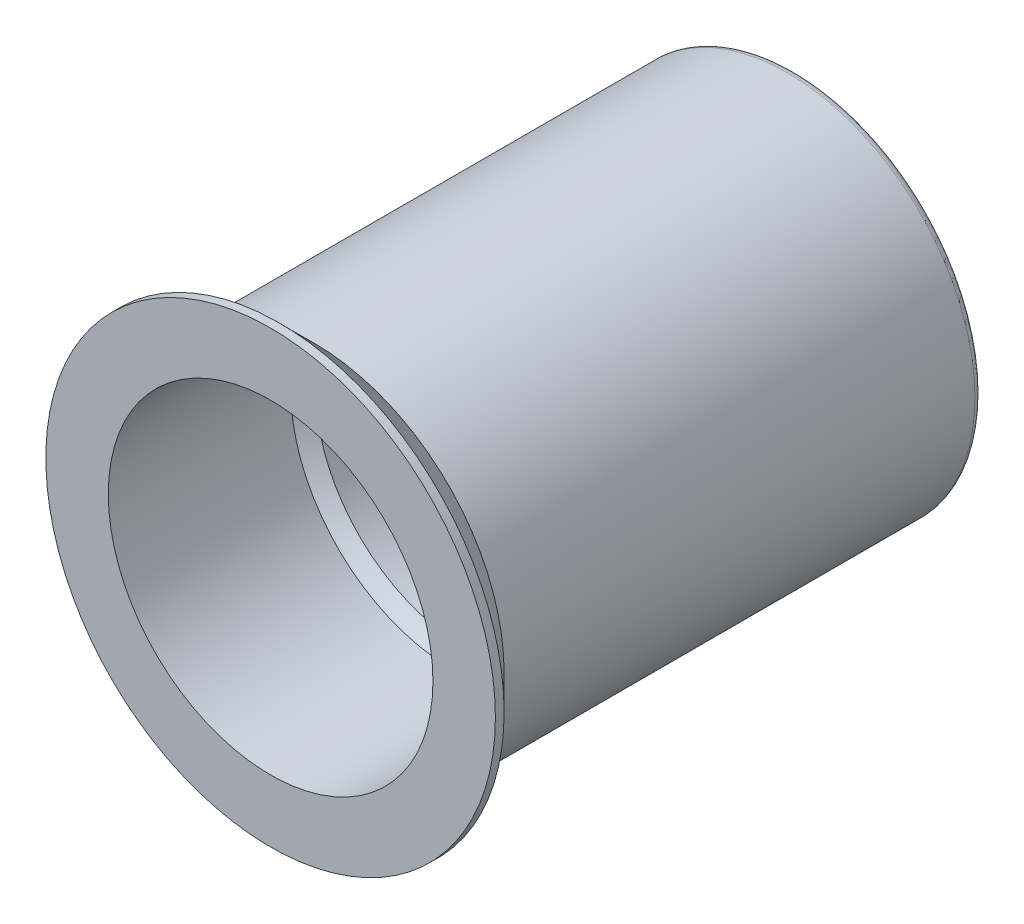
ISO-10303-21;
HEADER;
FILE_DESCRIPTION(('STEP AP214'),'2;1');
FILE_NAME('part.step','',(''),(''),'','','');
FILE_SCHEMA(('AUTOMOTIVE_DESIGN { 1 0 10303 214 1 1 1 1 }'));
ENDSEC;
DATA;
#1=APPLICATION_CONTEXT('core data for automotive mechanical design processes');
#2=APPLICATION_PROTOCOL_DEFINITION('international standard','automotive_design',2000,#1);
#3=PRODUCT_CONTEXT('',#1,'mechanical');
#4=PRODUCT('Part','Part','',(#3));
#5=PRODUCT_RELATED_PRODUCT_CATEGORY('part','',(#4));
#6=PRODUCT_DEFINITION_FORMATION('','',#4);
#7=PRODUCT_DEFINITION_CONTEXT('part definition',#1,'design');
#8=PRODUCT_DEFINITION('design','',#6,#7);
#9=PRODUCT_DEFINITION_SHAPE('','',#8);
#10=(LENGTH_UNIT() NAMED_UNIT(*) SI_UNIT(.MILLI.,.METRE.));
#11=(NAMED_UNIT(*) PLANE_ANGLE_UNIT() SI_UNIT($,.RADIAN.));
#12=(NAMED_UNIT(*) SI_UNIT($,.STERADIAN.) SOLID_ANGLE_UNIT());
#13=UNCERTAINTY_MEASURE_WITH_UNIT(LENGTH_MEASURE(1.E-05),#10,'distance_accuracy_value','');
#14=(GEOMETRIC_REPRESENTATION_CONTEXT(3) GLOBAL_UNCERTAINTY_ASSIGNED_CONTEXT((#13)) GLOBAL_UNIT_ASSIGNED_CONTEXT((#10,
#11,#12)) REPRESENTATION_CONTEXT('',''));
#15=CARTESIAN_POINT('',(0.,0.,0.));
#16=DIRECTION('',(0.,0.,1.));
#17=DIRECTION('',(1.,0.,0.));
#18=AXIS2_PLACEMENT_3D('',#15,#16,#17);
#19=CARTESIAN_POINT('',(0.,0.,-21.0000000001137));
#20=DIRECTION('',(0.,0.,1.));
#21=DIRECTION('',(1.,0.,0.));
#22=AXIS2_PLACEMENT_3D('',#19,#20,#21);
#23=CYLINDRICAL_SURFACE('',#22,7.5);
#24=CARTESIAN_POINT('',(0.,0.,-20.7000000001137));
#25=DIRECTION('',(0.,0.,-1.));
#26=DIRECTION('',(-1.,0.,0.));
#27=AXIS2_PLACEMENT_3D('',#24,#25,#26);
#28=CIRCLE('',#27,7.5);
#29=CARTESIAN_POINT('',(7.5,0.,-20.7000000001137));
#30=VERTEX_POINT('',#29);
#31=EDGE_CURVE('E53',#30,#30,#28,.F.);
#32=CARTESIAN_POINT('',(0.,0.,-1.8));
#33=DIRECTION('',(0.,0.,1.));
#34=DIRECTION('',(1.,0.,0.));
#35=AXIS2_PLACEMENT_3D('',#32,#33,#34);
#36=CIRCLE('',#35,7.5);
#37=CARTESIAN_POINT('',(7.5,0.,-1.8));
#38=VERTEX_POINT('',#37);
#39=EDGE_CURVE('E59',#38,#38,#36,.F.);
#40=CARTESIAN_POINT('',(7.5,0.,-20.7000000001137));
#41=CARTESIAN_POINT('',(7.5,0.,-20.5031250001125));
#42=CARTESIAN_POINT('',(7.5,0.,-20.3062500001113));
#43=CARTESIAN_POINT('',(7.5,0.,-19.9125000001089));
#44=CARTESIAN_POINT('',(7.5,0.,-19.7156250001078));
#45=CARTESIAN_POINT('',(7.5,0.,-19.3218750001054));
#46=CARTESIAN_POINT('',(7.5,0.,-19.1250000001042));
#47=CARTESIAN_POINT('',(7.5,0.,-18.7312500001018));
#48=CARTESIAN_POINT('',(7.5,0.,-18.5343750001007));
#49=CARTESIAN_POINT('',(7.5,0.,-18.1406250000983));
#50=CARTESIAN_POINT('',(7.5,0.,-17.9437500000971));
#51=CARTESIAN_POINT('',(7.5,0.,-17.5500000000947));
#52=CARTESIAN_POINT('',(7.5,0.,-17.3531250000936));
#53=CARTESIAN_POINT('',(7.5,0.,-16.9593750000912));
#54=CARTESIAN_POINT('',(7.5,0.,-16.76250000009));
#55=CARTESIAN_POINT('',(7.5,0.,-16.3687500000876));
#56=CARTESIAN_POINT('',(7.5,0.,-16.1718750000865));
#57=CARTESIAN_POINT('',(7.5,0.,-15.7781250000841));
#58=CARTESIAN_POINT('',(7.5,0.,-15.5812500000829));
#59=CARTESIAN_POINT('',(7.5,0.,-15.1875000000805));
#60=CARTESIAN_POINT('',(7.5,0.,-14.9906250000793));
#61=CARTESIAN_POINT('',(7.5,0.,-14.596875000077));
#62=CARTESIAN_POINT('',(7.5,0.,-14.4000000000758));
#63=CARTESIAN_POINT('',(7.5,0.,-14.0062500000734));
#64=CARTESIAN_POINT('',(7.5,0.,-13.8093750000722));
#65=CARTESIAN_POINT('',(7.5,0.,-13.4156250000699));
#66=CARTESIAN_POINT('',(7.5,0.,-13.2187500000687));
#67=CARTESIAN_POINT('',(7.5,0.,-12.8250000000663));
#68=CARTESIAN_POINT('',(7.5,0.,-12.6281250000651));
#69=CARTESIAN_POINT('',(7.5,0.,-12.2343750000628));
#70=CARTESIAN_POINT('',(7.5,0.,-12.0375000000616));
#71=CARTESIAN_POINT('',(7.5,0.,-11.6437500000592));
#72=CARTESIAN_POINT('',(7.5,0.,-11.446875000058));
#73=CARTESIAN_POINT('',(7.5,0.,-11.0531250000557));
#74=CARTESIAN_POINT('',(7.5,0.,-10.8562500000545));
#75=CARTESIAN_POINT('',(7.5,0.,-10.4625000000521));
#76=CARTESIAN_POINT('',(7.5,0.,-10.2656250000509));
#77=CARTESIAN_POINT('',(7.5,0.,-9.87187500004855));
#78=CARTESIAN_POINT('',(7.5,0.,-9.67500000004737));
#79=CARTESIAN_POINT('',(7.5,0.,-9.281250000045));
#80=CARTESIAN_POINT('',(7.5,0.,-9.08437500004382));
#81=CARTESIAN_POINT('',(7.5,0.,-8.69062500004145));
#82=CARTESIAN_POINT('',(7.5,0.,-8.49375000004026));
#83=CARTESIAN_POINT('',(7.5,0.,-8.10000000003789));
#84=CARTESIAN_POINT('',(7.5,0.,-7.90312500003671));
#85=CARTESIAN_POINT('',(7.5,0.,-7.50937500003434));
#86=CARTESIAN_POINT('',(7.5,0.,-7.31250000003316));
#87=CARTESIAN_POINT('',(7.5,0.,-6.91875000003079));
#88=CARTESIAN_POINT('',(7.5,0.,-6.72187500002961));
#89=CARTESIAN_POINT('',(7.5,0.,-6.32812500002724));
#90=CARTESIAN_POINT('',(7.5,0.,-6.13125000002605));
#91=CARTESIAN_POINT('',(7.5,0.,-5.73750000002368));
#92=CARTESIAN_POINT('',(7.5,0.,-5.5406250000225));
#93=CARTESIAN_POINT('',(7.5,0.,-5.14687500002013));
#94=CARTESIAN_POINT('',(7.5,0.,-4.95000000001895));
#95=CARTESIAN_POINT('',(7.5,0.,-4.55625000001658));
#96=CARTESIAN_POINT('',(7.5,0.,-4.3593750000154));
#97=CARTESIAN_POINT('',(7.5,0.,-3.96562500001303));
#98=CARTESIAN_POINT('',(7.5,0.,-3.76875000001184));
#99=CARTESIAN_POINT('',(7.5,0.,-3.37500000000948));
#100=CARTESIAN_POINT('',(7.5,0.,-3.17812500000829));
#101=CARTESIAN_POINT('',(7.5,0.,-2.78437500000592));
#102=CARTESIAN_POINT('',(7.5,0.,-2.58750000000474));
#103=CARTESIAN_POINT('',(7.5,0.,-2.19375000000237));
#104=CARTESIAN_POINT('',(7.5,0.,-1.99687500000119));
#105=CARTESIAN_POINT('',(7.5,0.,-1.8));
#106=B_SPLINE_CURVE_WITH_KNOTS('',3,(#40,#41,#42,#43,#44,#45,#46,#47,#48,#49,#50,#51,#52,#53,
#54,#55,#56,#57,#58,#59,#60,#61,#62,#63,#64,#65,#66,#67,#68,#69,#70,#71,#72,#73,#74,#75,#76,#77,
#78,#79,#80,#81,#82,#83,#84,#85,#86,#87,#88,#89,#90,#91,#92,#93,#94,#95,#96,#97,#98,#99,#100,
#101,#102,#103,#104,#105),.UNSPECIFIED.,.F.,.F.,(4,2,2,2,2,2,2,2,2,2,2,2,2,2,2,2,2,2,2,2,2,2,2,
2,2,2,2,2,2,2,2,2,4),(0.,0.590625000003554,1.18125000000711,1.77187500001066,2.36250000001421,
2.95312500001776,3.54375000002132,4.13437500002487,4.72500000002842,5.31562500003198,
5.90625000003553,6.49687500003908,7.08750000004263,7.67812500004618,8.26875000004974,
8.85937500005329,9.45000000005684,10.0406250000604,10.6312500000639,11.2218750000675,
11.8125000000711,12.4031250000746,12.9937500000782,13.5843750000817,14.1750000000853,
14.7656250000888,15.3562500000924,15.9468750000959,16.5375000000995,17.128125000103,
17.7187500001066,18.3093750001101,18.9000000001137),.UNSPECIFIED.);
#107=EDGE_CURVE('BSEAM33',#30,#38,#106,.T.);
#108=ORIENTED_EDGE('',*,*,#31,.T.);
#109=ORIENTED_EDGE('',*,*,#39,.T.);
#110=ORIENTED_EDGE('',*,*,#107,.T.);
#111=ORIENTED_EDGE('',*,*,#107,.F.);
#112=EDGE_LOOP('',(#108,#110,#109,#111));
#113=FACE_BOUND('',#112,.T.);
#114=ADVANCED_FACE('F33',(#113),#23,.T.);
#115=CARTESIAN_POINT('',(0.,0.,-21.0000000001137));
#116=DIRECTION('',(0.,0.,-1.));
#117=DIRECTION('',(-1.,0.,0.));
#118=AXIS2_PLACEMENT_3D('',#115,#116,#117);
#119=PLANE('',#118);
#120=CARTESIAN_POINT('',(0.,0.,-21.0000000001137));
#121=DIRECTION('',(0.,0.,-1.));
#122=DIRECTION('',(-1.,0.,0.));
#123=AXIS2_PLACEMENT_3D('',#120,#121,#122);
#124=CIRCLE('',#123,6.48);
#125=CARTESIAN_POINT('',(-6.48,0.,-21.0000000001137));
#126=VERTEX_POINT('',#125);
#127=EDGE_CURVE('E40',#126,#126,#124,.F.);
#128=ORIENTED_EDGE('',*,*,#127,.T.);
#129=EDGE_LOOP('',(#128));
#130=FACE_BOUND('',#129,.T.);
#131=CARTESIAN_POINT('',(0.,0.,-21.0000000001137));
#132=DIRECTION('',(0.,0.,-1.));
#133=DIRECTION('',(-1.,0.,0.));
#134=AXIS2_PLACEMENT_3D('',#131,#132,#133);
#135=CIRCLE('',#134,7.2);
#136=CARTESIAN_POINT('',(-7.2,0.,-21.0000000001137));
#137=VERTEX_POINT('',#136);
#138=EDGE_CURVE('E56',#137,#137,#135,.T.);
#139=ORIENTED_EDGE('',*,*,#138,.T.);
#140=EDGE_LOOP('',(#139));
#141=FACE_BOUND('',#140,.T.);
#142=ADVANCED_FACE('F99',(#130,#141),#119,.T.);
#143=CARTESIAN_POINT('',(0.,0.,-0.350000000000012));
#144=DIRECTION('',(0.,0.,1.));
#145=DIRECTION('',(1.,0.,0.));
#146=AXIS2_PLACEMENT_3D('',#143,#144,#145);
#147=CONICAL_SURFACE('',#146,9.,0.785398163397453);
#148=CARTESIAN_POINT('',(0.,0.,-1.72509203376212));
#149=DIRECTION('',(0.,0.,1.));
#150=DIRECTION('',(1.,0.,0.));
#151=AXIS2_PLACEMENT_3D('',#148,#149,#150);
#152=CIRCLE('',#151,7.62490796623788);
#153=CARTESIAN_POINT('',(7.62490796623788,0.,-1.72509203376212));
#154=VERTEX_POINT('',#153);
#155=EDGE_CURVE('E48',#154,#154,#152,.T.);
#156=ORIENTED_EDGE('',*,*,#155,.T.);
#157=EDGE_LOOP('',(#156));
#158=FACE_BOUND('',#157,.T.);
#159=CARTESIAN_POINT('',(0.,0.,-0.350000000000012));
#160=DIRECTION('',(0.,0.,1.));
#161=DIRECTION('',(1.,0.,0.));
#162=AXIS2_PLACEMENT_3D('',#159,#160,#161);
#163=CIRCLE('',#162,9.);
#164=CARTESIAN_POINT('',(9.,0.,-0.350000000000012));
#165=VERTEX_POINT('',#164);
#166=EDGE_CURVE('E63',#165,#165,#163,.T.);
#167=ORIENTED_EDGE('',*,*,#166,.F.);
#168=EDGE_LOOP('',(#167));
#169=FACE_BOUND('',#168,.T.);
#170=ADVANCED_FACE('F89',(#158,#169),#147,.T.);
#171=CARTESIAN_POINT('',(0.,0.,0.));
#172=DIRECTION('',(0.,0.,1.));
#173=DIRECTION('',(1.,0.,0.));
#174=AXIS2_PLACEMENT_3D('',#171,#172,#173);
#175=PLANE('',#174);
#176=CARTESIAN_POINT('',(0.,0.,5.6843418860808E-11));
#177=DIRECTION('',(0.,0.,1.));
#178=DIRECTION('',(1.,0.,0.));
#179=AXIS2_PLACEMENT_3D('',#176,#177,#178);
#180=CIRCLE('',#179,6.5);
#181=CARTESIAN_POINT('',(6.5,0.,5.6843418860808E-11));
#182=VERTEX_POINT('',#181);
#183=EDGE_CURVE('E69',#182,#182,#180,.T.);
#184=ORIENTED_EDGE('',*,*,#183,.F.);
#185=EDGE_LOOP('',(#184));
#186=FACE_BOUND('',#185,.T.);
#187=CARTESIAN_POINT('',(0.,0.,0.));
#188=DIRECTION('',(0.,0.,1.));
#189=DIRECTION('',(1.,0.,0.));
#190=AXIS2_PLACEMENT_3D('',#187,#188,#189);
#191=CIRCLE('',#190,9.);
#192=CARTESIAN_POINT('',(9.,0.,0.));
#193=VERTEX_POINT('',#192);
#194=EDGE_CURVE('E60',#193,#193,#191,.T.);
#195=ORIENTED_EDGE('',*,*,#194,.T.);
#196=EDGE_LOOP('',(#195));
#197=FACE_BOUND('',#196,.T.);
#198=ADVANCED_FACE('F86',(#186,#197),#175,.T.);
#199=CARTESIAN_POINT('',(0.,0.,-1.8));
#200=DIRECTION('',(0.,0.,1.));
#201=DIRECTION('',(1.,0.,0.));
#202=AXIS2_PLACEMENT_3D('',#199,#200,#201);
#203=CYLINDRICAL_SURFACE('',#202,9.);
#204=ORIENTED_EDGE('',*,*,#194,.F.);
#205=EDGE_LOOP('',(#204));
#206=FACE_BOUND('',#205,.T.);
#207=ORIENTED_EDGE('',*,*,#166,.T.);
#208=EDGE_LOOP('',(#207));
#209=FACE_BOUND('',#208,.T.);
#210=ADVANCED_FACE('F82',(#206,#209),#203,.T.);
#211=CARTESIAN_POINT('',(0.,0.,-7.29999999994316));
#212=DIRECTION('',(0.,0.,1.));
#213=DIRECTION('',(1.,0.,0.));
#214=AXIS2_PLACEMENT_3D('',#211,#212,#213);
#215=CYLINDRICAL_SURFACE('',#214,6.5);
#216=CARTESIAN_POINT('',(0.,0.,-7.29999999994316));
#217=DIRECTION('',(0.,0.,1.));
#218=DIRECTION('',(1.,0.,0.));
#219=AXIS2_PLACEMENT_3D('',#216,#217,#218);
#220=CIRCLE('',#219,6.5);
#221=CARTESIAN_POINT('',(6.5,0.,-7.29999999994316));
#222=VERTEX_POINT('',#221);
#223=EDGE_CURVE('E68',#222,#222,#220,.T.);
#224=ORIENTED_EDGE('',*,*,#223,.F.);
#225=EDGE_LOOP('',(#224));
#226=FACE_BOUND('',#225,.T.);
#227=ORIENTED_EDGE('',*,*,#183,.T.);
#228=EDGE_LOOP('',(#227));
#229=FACE_BOUND('',#228,.T.);
#230=ADVANCED_FACE('F78',(#226,#229),#215,.F.);
#231=CARTESIAN_POINT('',(0.,0.,-21.0000000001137));
#232=DIRECTION('',(0.,0.,1.));
#233=DIRECTION('',(1.,0.,0.));
#234=AXIS2_PLACEMENT_3D('',#231,#232,#233);
#235=CYLINDRICAL_SURFACE('',#234,6.);
#236=CARTESIAN_POINT('',(0.,0.,-20.5200000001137));
#237=DIRECTION('',(0.,0.,-1.));
#238=DIRECTION('',(-1.,0.,0.));
#239=AXIS2_PLACEMENT_3D('',#236,#237,#238);
#240=CIRCLE('',#239,6.);
#241=CARTESIAN_POINT('',(-6.,0.,-20.5200000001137));
#242=VERTEX_POINT('',#241);
#243=EDGE_CURVE('E10',#242,#242,#240,.T.);
#244=ORIENTED_EDGE('',*,*,#243,.T.);
#245=EDGE_LOOP('',(#244));
#246=FACE_BOUND('',#245,.T.);
#247=CARTESIAN_POINT('',(0.,0.,-7.80000000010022));
#248=DIRECTION('',(0.,0.,1.));
#249=DIRECTION('',(1.,0.,0.));
#250=AXIS2_PLACEMENT_3D('',#247,#248,#249);
#251=CIRCLE('',#250,6.);
#252=CARTESIAN_POINT('',(6.,0.,-7.80000000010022));
#253=VERTEX_POINT('',#252);
#254=EDGE_CURVE('E44',#253,#253,#251,.T.);
#255=ORIENTED_EDGE('',*,*,#254,.T.);
#256=EDGE_LOOP('',(#255));
#257=FACE_BOUND('',#256,.T.);
#258=ADVANCED_FACE('F81',(#246,#257),#235,.F.);
#259=CARTESIAN_POINT('',(0.,0.,-20.7000000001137));
#260=DIRECTION('',(0.,0.,-1.));
#261=DIRECTION('',(-1.,0.,0.));
#262=AXIS2_PLACEMENT_3D('',#259,#260,#261);
#263=TOROIDAL_SURFACE('',#262,7.2,0.3);
#264=ORIENTED_EDGE('',*,*,#31,.F.);
#265=EDGE_LOOP('',(#264));
#266=FACE_BOUND('',#265,.T.);
#267=ORIENTED_EDGE('',*,*,#138,.F.);
#268=EDGE_LOOP('',(#267));
#269=FACE_BOUND('',#268,.T.);
#270=ADVANCED_FACE('F113',(#266,#269),#263,.T.);
#271=CARTESIAN_POINT('',(0.,0.,-1.51295999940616));
#272=DIRECTION('',(0.,0.,-1.));
#273=DIRECTION('',(-1.,0.,0.));
#274=AXIS2_PLACEMENT_3D('',#271,#272,#273);
#275=TOROIDAL_SURFACE('',#274,7.41277593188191,0.3);
#276=ORIENTED_EDGE('',*,*,#39,.F.);
#277=EDGE_LOOP('',(#276));
#278=FACE_BOUND('',#277,.T.);
#279=ORIENTED_EDGE('',*,*,#155,.F.);
#280=EDGE_LOOP('',(#279));
#281=FACE_BOUND('',#280,.T.);
#282=ADVANCED_FACE('F116',(#278,#281),#275,.T.);
#283=CARTESIAN_POINT('',(0.,0.,-7.80000000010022));
#284=DIRECTION('',(0.,0.,1.));
#285=DIRECTION('',(1.,0.,0.));
#286=AXIS2_PLACEMENT_3D('',#283,#284,#285);
#287=CONICAL_SURFACE('',#286,6.,0.785398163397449);
#288=ORIENTED_EDGE('',*,*,#223,.T.);
#289=EDGE_LOOP('',(#288));
#290=FACE_BOUND('',#289,.T.);
#291=ORIENTED_EDGE('',*,*,#254,.F.);
#292=EDGE_LOOP('',(#291));
#293=FACE_BOUND('',#292,.T.);
#294=ADVANCED_FACE('F75',(#290,#293),#287,.F.);
#295=CARTESIAN_POINT('',(0.,0.,-21.0000000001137));
#296=DIRECTION('',(0.,0.,-1.));
#297=DIRECTION('',(-1.,0.,0.));
#298=AXIS2_PLACEMENT_3D('',#295,#296,#297);
#299=CONICAL_SURFACE('',#298,6.48,0.785398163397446);
#300=ORIENTED_EDGE('',*,*,#243,.F.);
#301=EDGE_LOOP('',(#300));
#302=FACE_BOUND('',#301,.T.);
#303=ORIENTED_EDGE('',*,*,#127,.F.);
#304=EDGE_LOOP('',(#303));
#305=FACE_BOUND('',#304,.T.);
#306=ADVANCED_FACE('F35',(#302,#305),#299,.F.);
#307=CLOSED_SHELL('',(#114,#142,#170,#198,#210,#230,#258,#270,#282,#294,#306));
#308=MANIFOLD_SOLID_BREP('B2',#307);
#309=ADVANCED_BREP_SHAPE_REPRESENTATION('',(#18,#308),#14);
#310=SHAPE_DEFINITION_REPRESENTATION(#9,#309);
ENDSEC;
END-ISO-10303-21;
